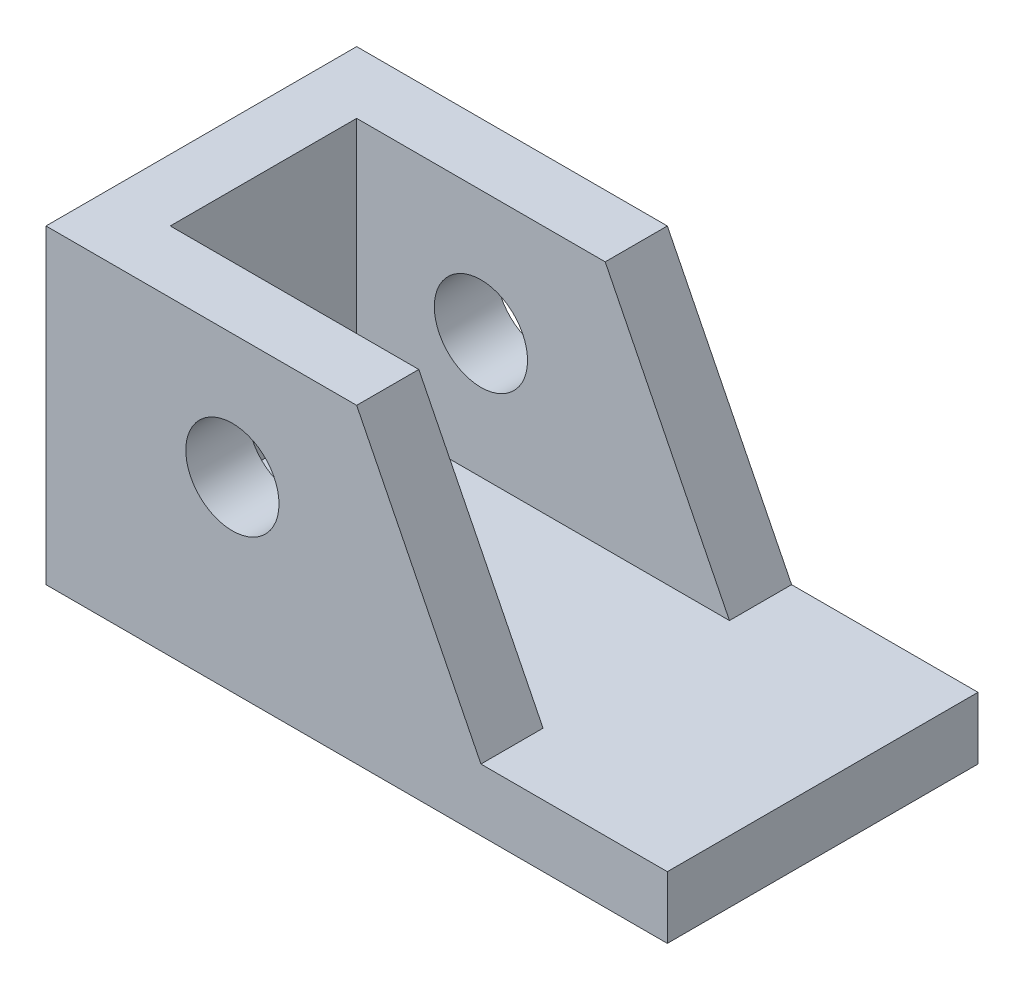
ISO-10303-21;
HEADER;
FILE_DESCRIPTION(('STEP AP214'),'2;1');
FILE_NAME('part.step','',(''),(''),'','','');
FILE_SCHEMA(('AUTOMOTIVE_DESIGN { 1 0 10303 214 1 1 1 1 }'));
ENDSEC;
DATA;
#1=APPLICATION_CONTEXT('core data for automotive mechanical design processes');
#2=APPLICATION_PROTOCOL_DEFINITION('international standard','automotive_design',2000,#1);
#3=PRODUCT_CONTEXT('',#1,'mechanical');
#4=PRODUCT('Part','Part','',(#3));
#5=PRODUCT_RELATED_PRODUCT_CATEGORY('part','',(#4));
#6=PRODUCT_DEFINITION_FORMATION('','',#4);
#7=PRODUCT_DEFINITION_CONTEXT('part definition',#1,'design');
#8=PRODUCT_DEFINITION('design','',#6,#7);
#9=PRODUCT_DEFINITION_SHAPE('','',#8);
#10=(LENGTH_UNIT() NAMED_UNIT(*) SI_UNIT(.MILLI.,.METRE.));
#11=(NAMED_UNIT(*) PLANE_ANGLE_UNIT() SI_UNIT($,.RADIAN.));
#12=(NAMED_UNIT(*) SI_UNIT($,.STERADIAN.) SOLID_ANGLE_UNIT());
#13=UNCERTAINTY_MEASURE_WITH_UNIT(LENGTH_MEASURE(1.E-05),#10,'distance_accuracy_value','');
#14=(GEOMETRIC_REPRESENTATION_CONTEXT(3) GLOBAL_UNCERTAINTY_ASSIGNED_CONTEXT((#13)) GLOBAL_UNIT_ASSIGNED_CONTEXT((#10,
#11,#12)) REPRESENTATION_CONTEXT('',''));
#15=CARTESIAN_POINT('',(0.,0.,0.));
#16=DIRECTION('',(0.,0.,1.));
#17=DIRECTION('',(1.,0.,0.));
#18=AXIS2_PLACEMENT_3D('',#15,#16,#17);
#19=CARTESIAN_POINT('',(70.,9.99999999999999,-50.));
#20=DIRECTION('',(-0.894427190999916,-0.447213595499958,0.));
#21=DIRECTION('',(0.447213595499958,-0.894427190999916,0.));
#22=AXIS2_PLACEMENT_3D('',#19,#20,#21);
#23=PLANE('',#22);
#24=DIRECTION('',(0.,0.,1.));
#25=VECTOR('',#24,1.);
#26=CARTESIAN_POINT('',(70.,9.99999999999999,-50.));
#27=LINE('',#26,#25);
#28=CARTESIAN_POINT('',(70.,9.99999999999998,-10.));
#29=VERTEX_POINT('',#28);
#30=CARTESIAN_POINT('',(70.,9.99999999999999,0.));
#31=VERTEX_POINT('',#30);
#32=EDGE_CURVE('E158',#29,#31,#27,.T.);
#33=ORIENTED_EDGE('',*,*,#32,.F.);
#34=DIRECTION('',(-0.447213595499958,0.894427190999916,0.));
#35=VECTOR('',#34,1.);
#36=CARTESIAN_POINT('',(70.,9.99999999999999,-10.));
#37=LINE('',#36,#35);
#38=CARTESIAN_POINT('',(50.,50.,-10.));
#39=VERTEX_POINT('',#38);
#40=EDGE_CURVE('E11',#29,#39,#37,.T.);
#41=ORIENTED_EDGE('',*,*,#40,.T.);
#42=DIRECTION('',(0.,0.,1.));
#43=VECTOR('',#42,1.);
#44=CARTESIAN_POINT('',(50.,50.,-50.));
#45=LINE('',#44,#43);
#46=CARTESIAN_POINT('',(50.,50.,0.));
#47=VERTEX_POINT('',#46);
#48=EDGE_CURVE('E147',#39,#47,#45,.T.);
#49=ORIENTED_EDGE('',*,*,#48,.T.);
#50=DIRECTION('',(0.447213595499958,-0.894427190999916,0.));
#51=VECTOR('',#50,1.);
#52=CARTESIAN_POINT('',(70.,9.99999999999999,0.));
#53=LINE('',#52,#51);
#54=EDGE_CURVE('E141',#47,#31,#53,.T.);
#55=ORIENTED_EDGE('',*,*,#54,.T.);
#56=EDGE_LOOP('',(#33,#41,#49,#55));
#57=FACE_BOUND('',#56,.T.);
#58=ADVANCED_FACE('F31',(#57),#23,.F.);
#59=CARTESIAN_POINT('',(0.,50.,0.));
#60=DIRECTION('',(1.,0.,0.));
#61=DIRECTION('',(0.,0.,-1.));
#62=AXIS2_PLACEMENT_3D('',#59,#60,#61);
#63=PLANE('',#62);
#64=DIRECTION('',(0.,0.,1.));
#65=VECTOR('',#64,1.);
#66=CARTESIAN_POINT('',(0.,0.,0.));
#67=LINE('',#66,#65);
#68=CARTESIAN_POINT('',(0.,0.,-50.));
#69=VERTEX_POINT('',#68);
#70=CARTESIAN_POINT('',(0.,0.,0.));
#71=VERTEX_POINT('',#70);
#72=EDGE_CURVE('E154',#69,#71,#67,.T.);
#73=ORIENTED_EDGE('',*,*,#72,.T.);
#74=DIRECTION('',(0.,-1.,0.));
#75=VECTOR('',#74,1.);
#76=CARTESIAN_POINT('',(0.,50.,0.));
#77=LINE('',#76,#75);
#78=CARTESIAN_POINT('',(0.,50.,0.));
#79=VERTEX_POINT('',#78);
#80=EDGE_CURVE('E186',#79,#71,#77,.T.);
#81=ORIENTED_EDGE('',*,*,#80,.F.);
#82=DIRECTION('',(0.,0.,1.));
#83=VECTOR('',#82,1.);
#84=CARTESIAN_POINT('',(0.,50.,0.));
#85=LINE('',#84,#83);
#86=CARTESIAN_POINT('',(0.,50.,-50.));
#87=VERTEX_POINT('',#86);
#88=EDGE_CURVE('E161',#87,#79,#85,.T.);
#89=ORIENTED_EDGE('',*,*,#88,.F.);
#90=DIRECTION('',(0.,-1.,0.));
#91=VECTOR('',#90,1.);
#92=CARTESIAN_POINT('',(0.,50.,-50.));
#93=LINE('',#92,#91);
#94=EDGE_CURVE('E170',#87,#69,#93,.T.);
#95=ORIENTED_EDGE('',*,*,#94,.T.);
#96=EDGE_LOOP('',(#73,#81,#89,#95));
#97=FACE_BOUND('',#96,.T.);
#98=ADVANCED_FACE('F33',(#97),#63,.F.);
#99=CARTESIAN_POINT('',(0.,50.,0.));
#100=DIRECTION('',(0.,0.,-1.));
#101=DIRECTION('',(-1.,0.,0.));
#102=AXIS2_PLACEMENT_3D('',#99,#100,#101);
#103=PLANE('',#102);
#104=CARTESIAN_POINT('',(30.,30.,0.));
#105=DIRECTION('',(0.,0.,1.));
#106=DIRECTION('',(1.,0.,0.));
#107=AXIS2_PLACEMENT_3D('',#104,#105,#106);
#108=CIRCLE('',#107,7.5);
#109=CARTESIAN_POINT('',(37.5,30.,0.));
#110=VERTEX_POINT('',#109);
#111=EDGE_CURVE('E256',#110,#110,#108,.T.);
#112=ORIENTED_EDGE('',*,*,#111,.F.);
#113=EDGE_LOOP('',(#112));
#114=FACE_BOUND('',#113,.T.);
#115=DIRECTION('',(0.,-1.,0.));
#116=VECTOR('',#115,1.);
#117=CARTESIAN_POINT('',(100.,50.,0.));
#118=LINE('',#117,#116);
#119=CARTESIAN_POINT('',(100.,10.,0.));
#120=VERTEX_POINT('',#119);
#121=CARTESIAN_POINT('',(100.,0.,0.));
#122=VERTEX_POINT('',#121);
#123=EDGE_CURVE('E184',#120,#122,#118,.T.);
#124=ORIENTED_EDGE('',*,*,#123,.F.);
#125=DIRECTION('',(1.,0.,0.));
#126=VECTOR('',#125,1.);
#127=CARTESIAN_POINT('',(100.,10.,0.));
#128=LINE('',#127,#126);
#129=EDGE_CURVE('E144',#31,#120,#128,.T.);
#130=ORIENTED_EDGE('',*,*,#129,.F.);
#131=ORIENTED_EDGE('',*,*,#54,.F.);
#132=DIRECTION('',(1.,0.,0.));
#133=VECTOR('',#132,1.);
#134=CARTESIAN_POINT('',(0.,50.,0.));
#135=LINE('',#134,#133);
#136=EDGE_CURVE('E164',#79,#47,#135,.T.);
#137=ORIENTED_EDGE('',*,*,#136,.F.);
#138=ORIENTED_EDGE('',*,*,#80,.T.);
#139=DIRECTION('',(1.,0.,0.));
#140=VECTOR('',#139,1.);
#141=CARTESIAN_POINT('',(0.,0.,0.));
#142=LINE('',#141,#140);
#143=EDGE_CURVE('E173',#71,#122,#142,.T.);
#144=ORIENTED_EDGE('',*,*,#143,.T.);
#145=EDGE_LOOP('',(#124,#130,#131,#137,#138,#144));
#146=FACE_BOUND('',#145,.T.);
#147=ADVANCED_FACE('F204',(#114,#146),#103,.F.);
#148=CARTESIAN_POINT('',(100.,50.,0.));
#149=DIRECTION('',(-1.,0.,0.));
#150=DIRECTION('',(0.,0.,1.));
#151=AXIS2_PLACEMENT_3D('',#148,#149,#150);
#152=PLANE('',#151);
#153=DIRECTION('',(0.,-1.,0.));
#154=VECTOR('',#153,1.);
#155=CARTESIAN_POINT('',(100.,50.,-50.));
#156=LINE('',#155,#154);
#157=CARTESIAN_POINT('',(100.,10.,-50.));
#158=VERTEX_POINT('',#157);
#159=CARTESIAN_POINT('',(100.,0.,-50.));
#160=VERTEX_POINT('',#159);
#161=EDGE_CURVE('E182',#158,#160,#156,.T.);
#162=ORIENTED_EDGE('',*,*,#161,.F.);
#163=DIRECTION('',(0.,0.,1.));
#164=VECTOR('',#163,1.);
#165=CARTESIAN_POINT('',(100.,10.,-50.));
#166=LINE('',#165,#164);
#167=EDGE_CURVE('E152',#158,#120,#166,.T.);
#168=ORIENTED_EDGE('',*,*,#167,.T.);
#169=ORIENTED_EDGE('',*,*,#123,.T.);
#170=DIRECTION('',(0.,0.,-1.));
#171=VECTOR('',#170,1.);
#172=CARTESIAN_POINT('',(100.,0.,0.));
#173=LINE('',#172,#171);
#174=EDGE_CURVE('E176',#122,#160,#173,.T.);
#175=ORIENTED_EDGE('',*,*,#174,.T.);
#176=EDGE_LOOP('',(#162,#168,#169,#175));
#177=FACE_BOUND('',#176,.T.);
#178=ADVANCED_FACE('F213',(#177),#152,.F.);
#179=CARTESIAN_POINT('',(0.,50.,-50.));
#180=DIRECTION('',(0.,0.,1.));
#181=DIRECTION('',(1.,0.,0.));
#182=AXIS2_PLACEMENT_3D('',#179,#180,#181);
#183=PLANE('',#182);
#184=CARTESIAN_POINT('',(30.,30.,-50.));
#185=DIRECTION('',(0.,0.,1.));
#186=DIRECTION('',(1.,0.,0.));
#187=AXIS2_PLACEMENT_3D('',#184,#185,#186);
#188=CIRCLE('',#187,7.5);
#189=CARTESIAN_POINT('',(37.5,30.,-50.));
#190=VERTEX_POINT('',#189);
#191=EDGE_CURVE('E259',#190,#190,#188,.T.);
#192=ORIENTED_EDGE('',*,*,#191,.T.);
#193=EDGE_LOOP('',(#192));
#194=FACE_BOUND('',#193,.T.);
#195=DIRECTION('',(0.447213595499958,-0.894427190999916,0.));
#196=VECTOR('',#195,1.);
#197=CARTESIAN_POINT('',(70.,9.99999999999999,-50.));
#198=LINE('',#197,#196);
#199=CARTESIAN_POINT('',(50.,50.,-50.));
#200=VERTEX_POINT('',#199);
#201=CARTESIAN_POINT('',(70.,9.99999999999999,-50.));
#202=VERTEX_POINT('',#201);
#203=EDGE_CURVE('E55',#200,#202,#198,.T.);
#204=ORIENTED_EDGE('',*,*,#203,.T.);
#205=DIRECTION('',(1.,0.,0.));
#206=VECTOR('',#205,1.);
#207=CARTESIAN_POINT('',(100.,10.,-50.));
#208=LINE('',#207,#206);
#209=EDGE_CURVE('E143',#202,#158,#208,.T.);
#210=ORIENTED_EDGE('',*,*,#209,.T.);
#211=ORIENTED_EDGE('',*,*,#161,.T.);
#212=DIRECTION('',(-1.,0.,0.));
#213=VECTOR('',#212,1.);
#214=CARTESIAN_POINT('',(0.,0.,-50.));
#215=LINE('',#214,#213);
#216=EDGE_CURVE('E165',#160,#69,#215,.T.);
#217=ORIENTED_EDGE('',*,*,#216,.T.);
#218=ORIENTED_EDGE('',*,*,#94,.F.);
#219=DIRECTION('',(-1.,0.,0.));
#220=VECTOR('',#219,1.);
#221=CARTESIAN_POINT('',(0.,50.,-50.));
#222=LINE('',#221,#220);
#223=EDGE_CURVE('E168',#200,#87,#222,.T.);
#224=ORIENTED_EDGE('',*,*,#223,.F.);
#225=EDGE_LOOP('',(#204,#210,#211,#217,#218,#224));
#226=FACE_BOUND('',#225,.T.);
#227=ADVANCED_FACE('F196',(#194,#226),#183,.F.);
#228=CARTESIAN_POINT('',(0.,50.,-50.));
#229=DIRECTION('',(0.,-1.,0.));
#230=DIRECTION('',(0.,0.,-1.));
#231=AXIS2_PLACEMENT_3D('',#228,#229,#230);
#232=PLANE('',#231);
#233=ORIENTED_EDGE('',*,*,#48,.F.);
#234=DIRECTION('',(1.,0.,0.));
#235=VECTOR('',#234,1.);
#236=CARTESIAN_POINT('',(10.,50.,-10.));
#237=LINE('',#236,#235);
#238=CARTESIAN_POINT('',(10.,50.,-10.));
#239=VERTEX_POINT('',#238);
#240=EDGE_CURVE('E115',#239,#39,#237,.T.);
#241=ORIENTED_EDGE('',*,*,#240,.F.);
#242=DIRECTION('',(0.,0.,1.));
#243=VECTOR('',#242,1.);
#244=CARTESIAN_POINT('',(10.,50.,-40.));
#245=LINE('',#244,#243);
#246=CARTESIAN_POINT('',(10.,50.,-40.));
#247=VERTEX_POINT('',#246);
#248=EDGE_CURVE('E122',#247,#239,#245,.T.);
#249=ORIENTED_EDGE('',*,*,#248,.F.);
#250=DIRECTION('',(-1.,0.,0.));
#251=VECTOR('',#250,1.);
#252=CARTESIAN_POINT('',(10.,50.,-40.));
#253=LINE('',#252,#251);
#254=CARTESIAN_POINT('',(50.,50.,-40.));
#255=VERTEX_POINT('',#254);
#256=EDGE_CURVE('E108',#255,#247,#253,.T.);
#257=ORIENTED_EDGE('',*,*,#256,.F.);
#258=EDGE_CURVE('E159',#200,#255,#45,.T.);
#259=ORIENTED_EDGE('',*,*,#258,.F.);
#260=ORIENTED_EDGE('',*,*,#223,.T.);
#261=ORIENTED_EDGE('',*,*,#88,.T.);
#262=ORIENTED_EDGE('',*,*,#136,.T.);
#263=EDGE_LOOP('',(#233,#241,#249,#257,#259,#260,#261,#262));
#264=FACE_BOUND('',#263,.T.);
#265=ADVANCED_FACE('F128',(#264),#232,.F.);
#266=CARTESIAN_POINT('',(0.,0.,-50.));
#267=DIRECTION('',(0.,-1.,0.));
#268=DIRECTION('',(0.,0.,-1.));
#269=AXIS2_PLACEMENT_3D('',#266,#267,#268);
#270=PLANE('',#269);
#271=ORIENTED_EDGE('',*,*,#72,.F.);
#272=ORIENTED_EDGE('',*,*,#216,.F.);
#273=ORIENTED_EDGE('',*,*,#174,.F.);
#274=ORIENTED_EDGE('',*,*,#143,.F.);
#275=EDGE_LOOP('',(#271,#272,#273,#274));
#276=FACE_BOUND('',#275,.T.);
#277=ADVANCED_FACE('F216',(#276),#270,.T.);
#278=CARTESIAN_POINT('',(100.,10.,-50.));
#279=DIRECTION('',(0.,-1.,0.));
#280=DIRECTION('',(1.,0.,0.));
#281=AXIS2_PLACEMENT_3D('',#278,#279,#280);
#282=PLANE('',#281);
#283=CARTESIAN_POINT('',(70.,9.99999999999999,-40.));
#284=VERTEX_POINT('',#283);
#285=EDGE_CURVE('E155',#202,#284,#27,.T.);
#286=ORIENTED_EDGE('',*,*,#285,.T.);
#287=DIRECTION('',(-1.,0.,0.));
#288=VECTOR('',#287,1.);
#289=CARTESIAN_POINT('',(9.99999999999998,9.99999999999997,-40.));
#290=LINE('',#289,#288);
#291=CARTESIAN_POINT('',(10.,9.99999999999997,-40.));
#292=VERTEX_POINT('',#291);
#293=EDGE_CURVE('E47',#284,#292,#290,.T.);
#294=ORIENTED_EDGE('',*,*,#293,.T.);
#295=DIRECTION('',(0.,0.,1.));
#296=VECTOR('',#295,1.);
#297=CARTESIAN_POINT('',(10.,9.99999999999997,-40.));
#298=LINE('',#297,#296);
#299=CARTESIAN_POINT('',(10.,9.99999999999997,-10.));
#300=VERTEX_POINT('',#299);
#301=EDGE_CURVE('E125',#292,#300,#298,.T.);
#302=ORIENTED_EDGE('',*,*,#301,.T.);
#303=DIRECTION('',(1.,0.,0.));
#304=VECTOR('',#303,1.);
#305=CARTESIAN_POINT('',(9.99999999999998,9.99999999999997,-10.));
#306=LINE('',#305,#304);
#307=EDGE_CURVE('E114',#300,#29,#306,.T.);
#308=ORIENTED_EDGE('',*,*,#307,.T.);
#309=ORIENTED_EDGE('',*,*,#32,.T.);
#310=ORIENTED_EDGE('',*,*,#129,.T.);
#311=ORIENTED_EDGE('',*,*,#167,.F.);
#312=ORIENTED_EDGE('',*,*,#209,.F.);
#313=EDGE_LOOP('',(#286,#294,#302,#308,#309,#310,#311,#312));
#314=FACE_BOUND('',#313,.T.);
#315=ADVANCED_FACE('F192',(#314),#282,.F.);
#316=ORIENTED_EDGE('',*,*,#258,.T.);
#317=DIRECTION('',(0.447213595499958,-0.894427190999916,0.));
#318=VECTOR('',#317,1.);
#319=CARTESIAN_POINT('',(70.,9.99999999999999,-40.));
#320=LINE('',#319,#318);
#321=EDGE_CURVE('E40',#255,#284,#320,.T.);
#322=ORIENTED_EDGE('',*,*,#321,.T.);
#323=ORIENTED_EDGE('',*,*,#285,.F.);
#324=ORIENTED_EDGE('',*,*,#203,.F.);
#325=EDGE_LOOP('',(#316,#322,#323,#324));
#326=FACE_BOUND('',#325,.T.);
#327=ADVANCED_FACE('F189',(#326),#23,.F.);
#328=CARTESIAN_POINT('',(10.,-84.8683298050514,-10.));
#329=DIRECTION('',(0.,0.,1.));
#330=DIRECTION('',(1.,0.,0.));
#331=AXIS2_PLACEMENT_3D('',#328,#329,#330);
#332=PLANE('',#331);
#333=CARTESIAN_POINT('',(30.,30.,-10.));
#334=DIRECTION('',(0.,0.,1.));
#335=DIRECTION('',(1.,0.,0.));
#336=AXIS2_PLACEMENT_3D('',#333,#334,#335);
#337=CIRCLE('',#336,7.5);
#338=CARTESIAN_POINT('',(37.5,30.,-10.));
#339=VERTEX_POINT('',#338);
#340=EDGE_CURVE('E129',#339,#339,#337,.T.);
#341=ORIENTED_EDGE('',*,*,#340,.T.);
#342=EDGE_LOOP('',(#341));
#343=FACE_BOUND('',#342,.T.);
#344=ORIENTED_EDGE('',*,*,#307,.F.);
#345=DIRECTION('',(0.,1.,0.));
#346=VECTOR('',#345,1.);
#347=CARTESIAN_POINT('',(10.,-84.8683298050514,-10.));
#348=LINE('',#347,#346);
#349=EDGE_CURVE('E138',#300,#239,#348,.T.);
#350=ORIENTED_EDGE('',*,*,#349,.T.);
#351=ORIENTED_EDGE('',*,*,#240,.T.);
#352=ORIENTED_EDGE('',*,*,#40,.F.);
#353=EDGE_LOOP('',(#344,#350,#351,#352));
#354=FACE_BOUND('',#353,.T.);
#355=ADVANCED_FACE('F211',(#343,#354),#332,.F.);
#356=CARTESIAN_POINT('',(10.,-84.8683298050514,-40.));
#357=DIRECTION('',(0.,0.,-1.));
#358=DIRECTION('',(-1.,0.,0.));
#359=AXIS2_PLACEMENT_3D('',#356,#357,#358);
#360=PLANE('',#359);
#361=CARTESIAN_POINT('',(30.,30.,-40.));
#362=DIRECTION('',(0.,0.,-1.));
#363=DIRECTION('',(-1.,0.,0.));
#364=AXIS2_PLACEMENT_3D('',#361,#362,#363);
#365=CIRCLE('',#364,7.5);
#366=CARTESIAN_POINT('',(22.5,30.,-40.));
#367=VERTEX_POINT('',#366);
#368=EDGE_CURVE('E35',#367,#367,#365,.T.);
#369=ORIENTED_EDGE('',*,*,#368,.T.);
#370=EDGE_LOOP('',(#369));
#371=FACE_BOUND('',#370,.T.);
#372=ORIENTED_EDGE('',*,*,#256,.T.);
#373=DIRECTION('',(0.,1.,0.));
#374=VECTOR('',#373,1.);
#375=CARTESIAN_POINT('',(10.,-84.8683298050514,-40.));
#376=LINE('',#375,#374);
#377=EDGE_CURVE('E111',#292,#247,#376,.T.);
#378=ORIENTED_EDGE('',*,*,#377,.F.);
#379=ORIENTED_EDGE('',*,*,#293,.F.);
#380=ORIENTED_EDGE('',*,*,#321,.F.);
#381=EDGE_LOOP('',(#372,#378,#379,#380));
#382=FACE_BOUND('',#381,.T.);
#383=ADVANCED_FACE('F110',(#371,#382),#360,.F.);
#384=CARTESIAN_POINT('',(10.,-84.8683298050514,-40.));
#385=DIRECTION('',(-1.,0.,0.));
#386=DIRECTION('',(0.,0.,1.));
#387=AXIS2_PLACEMENT_3D('',#384,#385,#386);
#388=PLANE('',#387);
#389=ORIENTED_EDGE('',*,*,#377,.T.);
#390=ORIENTED_EDGE('',*,*,#248,.T.);
#391=ORIENTED_EDGE('',*,*,#349,.F.);
#392=ORIENTED_EDGE('',*,*,#301,.F.);
#393=EDGE_LOOP('',(#389,#390,#391,#392));
#394=FACE_BOUND('',#393,.T.);
#395=ADVANCED_FACE('F120',(#394),#388,.F.);
#396=CARTESIAN_POINT('',(30.,30.,-50.));
#397=DIRECTION('',(0.,0.,1.));
#398=DIRECTION('',(1.,0.,0.));
#399=AXIS2_PLACEMENT_3D('',#396,#397,#398);
#400=CYLINDRICAL_SURFACE('',#399,7.5);
#401=ORIENTED_EDGE('',*,*,#191,.F.);
#402=EDGE_LOOP('',(#401));
#403=FACE_BOUND('',#402,.T.);
#404=ORIENTED_EDGE('',*,*,#368,.F.);
#405=EDGE_LOOP('',(#404));
#406=FACE_BOUND('',#405,.T.);
#407=ADVANCED_FACE('F245',(#403,#406),#400,.F.);
#408=ORIENTED_EDGE('',*,*,#111,.T.);
#409=EDGE_LOOP('',(#408));
#410=FACE_BOUND('',#409,.T.);
#411=ORIENTED_EDGE('',*,*,#340,.F.);
#412=EDGE_LOOP('',(#411));
#413=FACE_BOUND('',#412,.T.);
#414=ADVANCED_FACE('F246',(#410,#413),#400,.F.);
#415=CLOSED_SHELL('',(#58,#98,#147,#178,#227,#265,#277,#315,#327,#355,#383,#395,#407,#414));
#416=MANIFOLD_SOLID_BREP('B2',#415);
#417=ADVANCED_BREP_SHAPE_REPRESENTATION('',(#18,#416),#14);
#418=SHAPE_DEFINITION_REPRESENTATION(#9,#417);
ENDSEC;
END-ISO-10303-21;
